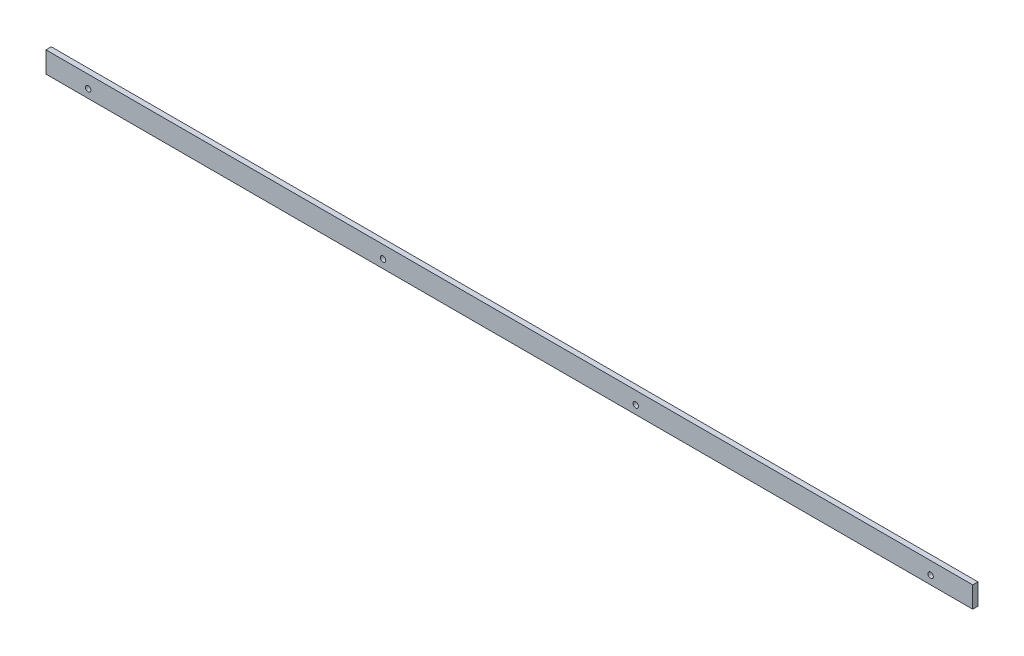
from build123d import *

# Parameters (mm, degrees)
SKETCH1_W             = 558.8
SKETCH1_H             = 12.7
BOSS_EXTRUDE1_DEPTH   = 3.175
F_4_CLEARANCE_HOLE1_D = 3.2639


with BuildPart() as part:
    # Sketch1 → Boss-Extrude1 (new body)
    with BuildSketch(Plane.XY):
        Rectangle(SKETCH1_W, SKETCH1_H)
    extrude(amount=BOSS_EXTRUDE1_DEPTH)

    # 4 Clearance Hole1 (through all)
    with Locations(Plane.XY.offset(3.175)):
        with Locations((-254, -1.27), (-76.2, -1.27), (76.2, -1.27), (254, -1.27)):
            Hole(F_4_CLEARANCE_HOLE1_D / 2)


solid = part.part
